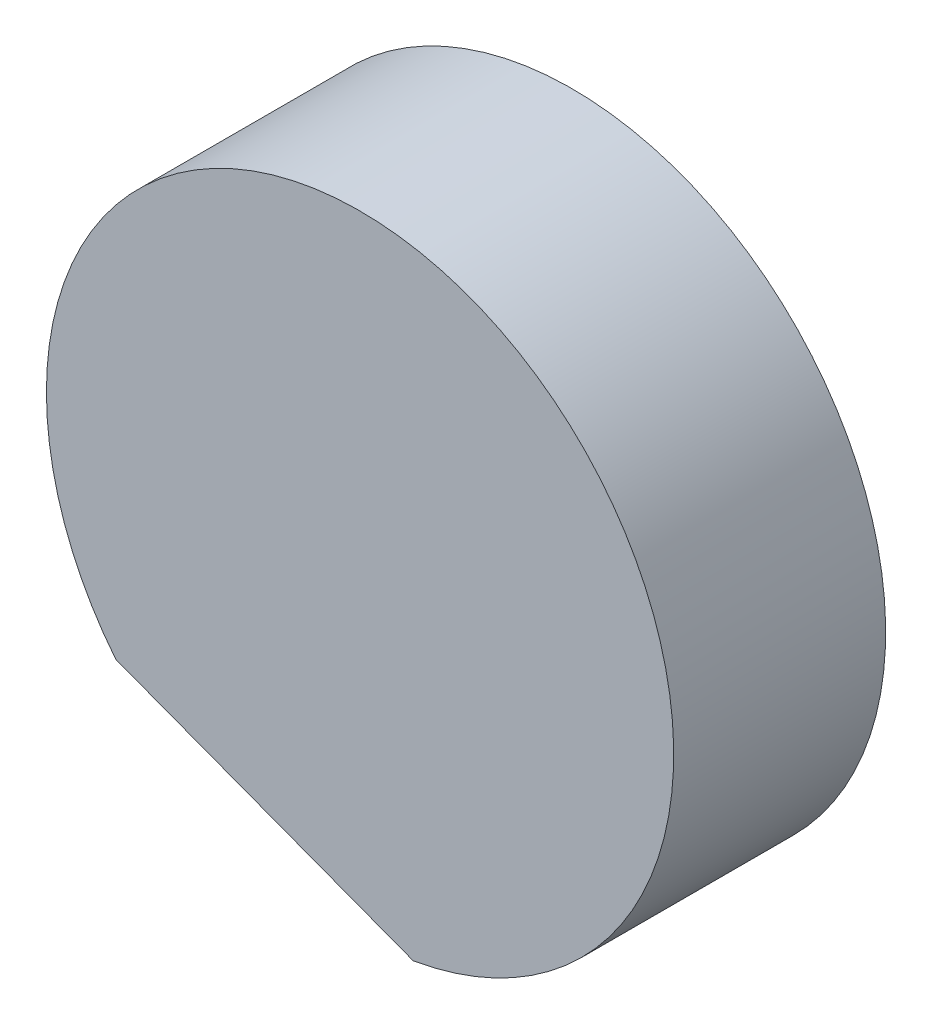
ISO-10303-21;
HEADER;
FILE_DESCRIPTION(('STEP AP214'),'2;1');
FILE_NAME('part.step','',(''),(''),'','','');
FILE_SCHEMA(('AUTOMOTIVE_DESIGN { 1 0 10303 214 1 1 1 1 }'));
ENDSEC;
DATA;
#1=APPLICATION_CONTEXT('core data for automotive mechanical design processes');
#2=APPLICATION_PROTOCOL_DEFINITION('international standard','automotive_design',2000,#1);
#3=PRODUCT_CONTEXT('',#1,'mechanical');
#4=PRODUCT('Part','Part','',(#3));
#5=PRODUCT_RELATED_PRODUCT_CATEGORY('part','',(#4));
#6=PRODUCT_DEFINITION_FORMATION('','',#4);
#7=PRODUCT_DEFINITION_CONTEXT('part definition',#1,'design');
#8=PRODUCT_DEFINITION('design','',#6,#7);
#9=PRODUCT_DEFINITION_SHAPE('','',#8);
#10=(LENGTH_UNIT() NAMED_UNIT(*) SI_UNIT(.MILLI.,.METRE.));
#11=(NAMED_UNIT(*) PLANE_ANGLE_UNIT() SI_UNIT($,.RADIAN.));
#12=(NAMED_UNIT(*) SI_UNIT($,.STERADIAN.) SOLID_ANGLE_UNIT());
#13=UNCERTAINTY_MEASURE_WITH_UNIT(LENGTH_MEASURE(1.E-05),#10,'distance_accuracy_value','');
#14=(GEOMETRIC_REPRESENTATION_CONTEXT(3) GLOBAL_UNCERTAINTY_ASSIGNED_CONTEXT((#13)) GLOBAL_UNIT_ASSIGNED_CONTEXT((#10,
#11,#12)) REPRESENTATION_CONTEXT('',''));
#15=CARTESIAN_POINT('',(0.,0.,0.));
#16=DIRECTION('',(0.,0.,1.));
#17=DIRECTION('',(1.,0.,0.));
#18=AXIS2_PLACEMENT_3D('',#15,#16,#17);
#19=CARTESIAN_POINT('',(15.9307859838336,-40.6521155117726,25.4));
#20=DIRECTION('',(0.353329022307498,0.935499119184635,0.));
#21=DIRECTION('',(-0.935499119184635,0.353329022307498,0.));
#22=AXIS2_PLACEMENT_3D('',#19,#20,#21);
#23=PLANE('',#22);
#24=DIRECTION('',(0.935499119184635,-0.353329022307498,0.));
#25=VECTOR('',#24,1.);
#26=CARTESIAN_POINT('',(15.9307859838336,-40.6521155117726,0.));
#27=LINE('',#26,#25);
#28=CARTESIAN_POINT('',(-29.269545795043,-23.5803848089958,0.));
#29=VERTEX_POINT('',#28);
#30=CARTESIAN_POINT('',(6.37297064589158,-37.0422205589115,0.));
#31=VERTEX_POINT('',#30);
#32=EDGE_CURVE('E58',#29,#31,#27,.T.);
#33=ORIENTED_EDGE('',*,*,#32,.T.);
#34=DIRECTION('',(0.,0.,-1.));
#35=VECTOR('',#34,1.);
#36=CARTESIAN_POINT('',(6.37297064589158,-37.0422205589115,25.4));
#37=LINE('',#36,#35);
#38=CARTESIAN_POINT('',(6.37297064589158,-37.0422205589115,25.4));
#39=VERTEX_POINT('',#38);
#40=EDGE_CURVE('E11',#39,#31,#37,.T.);
#41=ORIENTED_EDGE('',*,*,#40,.F.);
#42=DIRECTION('',(0.935499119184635,-0.353329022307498,0.));
#43=VECTOR('',#42,1.);
#44=CARTESIAN_POINT('',(15.9307859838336,-40.6521155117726,25.4));
#45=LINE('',#44,#43);
#46=CARTESIAN_POINT('',(-29.269545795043,-23.5803848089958,25.4));
#47=VERTEX_POINT('',#46);
#48=EDGE_CURVE('E60',#47,#39,#45,.T.);
#49=ORIENTED_EDGE('',*,*,#48,.F.);
#50=DIRECTION('',(0.,0.,-1.));
#51=VECTOR('',#50,1.);
#52=CARTESIAN_POINT('',(-29.269545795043,-23.5803848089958,25.4));
#53=LINE('',#52,#51);
#54=EDGE_CURVE('E38',#47,#29,#53,.T.);
#55=ORIENTED_EDGE('',*,*,#54,.T.);
#56=EDGE_LOOP('',(#33,#41,#49,#55));
#57=FACE_BOUND('',#56,.T.);
#58=ADVANCED_FACE('F31',(#57),#23,.F.);
#59=CARTESIAN_POINT('',(0.,0.,25.4));
#60=DIRECTION('',(0.,0.,-1.));
#61=DIRECTION('',(-1.,0.,0.));
#62=AXIS2_PLACEMENT_3D('',#59,#60,#61);
#63=CYLINDRICAL_SURFACE('',#62,37.586445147);
#64=CARTESIAN_POINT('',(0.,0.,0.));
#65=DIRECTION('',(0.,0.,1.));
#66=DIRECTION('',(1.,0.,0.));
#67=AXIS2_PLACEMENT_3D('',#64,#65,#66);
#68=CIRCLE('',#67,37.586445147);
#69=EDGE_CURVE('E55',#31,#29,#68,.T.);
#70=ORIENTED_EDGE('',*,*,#69,.T.);
#71=ORIENTED_EDGE('',*,*,#54,.F.);
#72=CARTESIAN_POINT('',(0.,0.,25.4));
#73=DIRECTION('',(0.,0.,1.));
#74=DIRECTION('',(1.,0.,0.));
#75=AXIS2_PLACEMENT_3D('',#72,#73,#74);
#76=CIRCLE('',#75,37.586445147);
#77=EDGE_CURVE('E44',#39,#47,#76,.T.);
#78=ORIENTED_EDGE('',*,*,#77,.F.);
#79=ORIENTED_EDGE('',*,*,#40,.T.);
#80=EDGE_LOOP('',(#70,#71,#78,#79));
#81=FACE_BOUND('',#80,.T.);
#82=ADVANCED_FACE('F63',(#81),#63,.T.);
#83=CARTESIAN_POINT('',(0.,-82.8316006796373,25.4));
#84=DIRECTION('',(0.,0.,1.));
#85=DIRECTION('',(1.,0.,0.));
#86=AXIS2_PLACEMENT_3D('',#83,#84,#85);
#87=PLANE('',#86);
#88=ORIENTED_EDGE('',*,*,#48,.T.);
#89=ORIENTED_EDGE('',*,*,#77,.T.);
#90=EDGE_LOOP('',(#88,#89));
#91=FACE_BOUND('',#90,.T.);
#92=ADVANCED_FACE('F69',(#91),#87,.T.);
#93=CARTESIAN_POINT('',(0.,-82.8316006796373,0.));
#94=DIRECTION('',(0.,0.,1.));
#95=DIRECTION('',(1.,0.,0.));
#96=AXIS2_PLACEMENT_3D('',#93,#94,#95);
#97=PLANE('',#96);
#98=ORIENTED_EDGE('',*,*,#32,.F.);
#99=ORIENTED_EDGE('',*,*,#69,.F.);
#100=EDGE_LOOP('',(#98,#99));
#101=FACE_BOUND('',#100,.T.);
#102=ADVANCED_FACE('F56',(#101),#97,.F.);
#103=CLOSED_SHELL('',(#58,#82,#92,#102));
#104=MANIFOLD_SOLID_BREP('B2',#103);
#105=ADVANCED_BREP_SHAPE_REPRESENTATION('',(#18,#104),#14);
#106=SHAPE_DEFINITION_REPRESENTATION(#9,#105);
ENDSEC;
END-ISO-10303-21;
